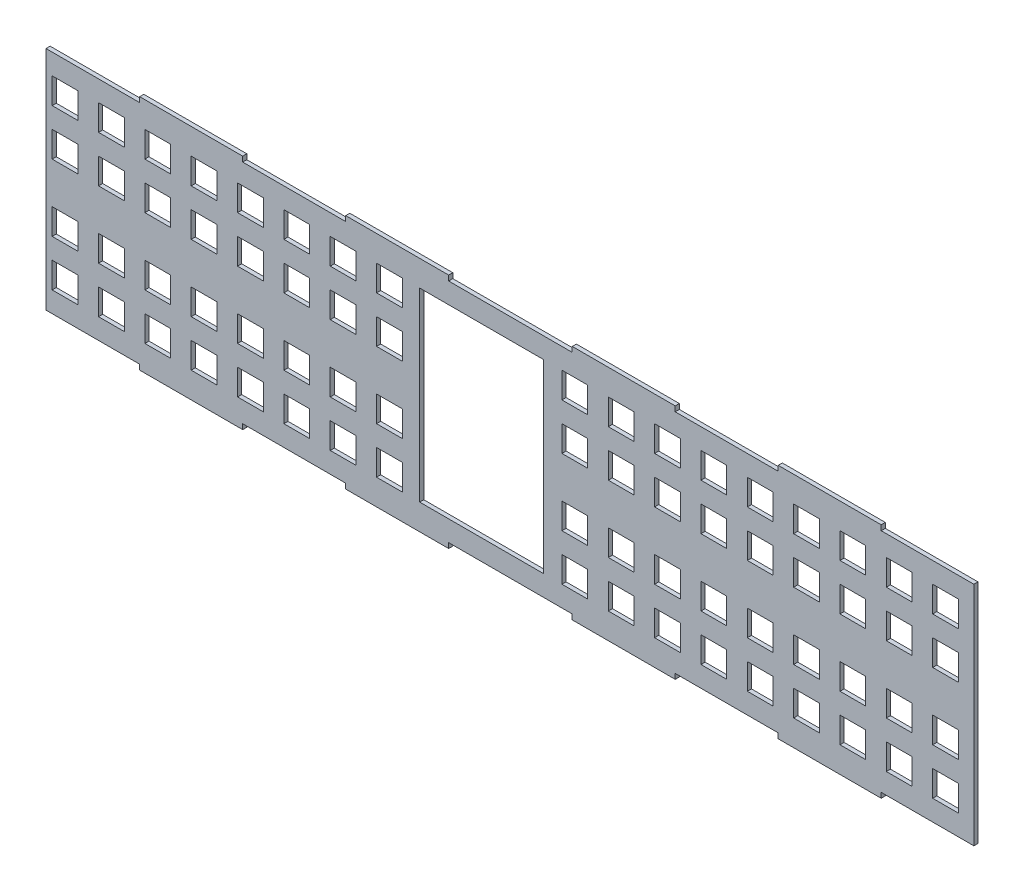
from build123d import *

# Parameters (mm, degrees)
SALIENTE_EXTRUIR1_DEPTH = 2
CROQUIS2_W              = 12.5
CROQUIS2_H              = 12.5
CORTAR_EXTRUIR1_DEPTH   = 5
CROQUIS5_W              = 12
CROQUIS5_H              = 110
CORTAR_EXTRUIR3_DEPTH   = 3
CROQUIS6_W              = 15
CROQUIS6_H              = 110
CORTAR_EXTRUIR4_DEPTH   = 3
CROQUIS7_W              = 2.5
CROQUIS7_H              = 110
CORTAR_EXTRUIR5_DEPTH   = 3
SKETCH1_W               = 60
SKETCH1_H               = 90
CUT_EXTRUDE1_DEPTH      = 3


with BuildPart() as part:
    # Croquis1 → Saliente-Extruir1 (new body)
    with BuildSketch(Plane.XY):
        Polygon((-240, -55), (-180, -55), (-180, -57.5), (-130, -57.5), (-130, -55), (-80, -55), (-80, -57.5), (-30, -57.5), (-30, -55), (30, -55), (30, -57.5), (80, -57.5), (80, -55), (130, -55), (130, -57.5), (180, -57.5), (180, -55), (240, -55), (240, 55), (180, 55), (180, 57.5), (130, 57.5), (130, 55), (80, 55), (80, 57.5), (30, 57.5), (30, 55), (-30, 55), (-30, 57.5), (-80, 57.5), (-80, 55), (-130, 55), (-130, 57.5), (-180, 57.5), (-180, 55), (-240, 55), align=None)
    extrude(amount=SALIENTE_EXTRUIR1_DEPTH)

    # Croquis2 → Cortar-Extruir1 (cut)
    with BuildSketch(Plane.XY.offset(2)):
        with Locations((-216.25, 16.25)):
            Rectangle(CROQUIS2_W, CROQUIS2_H)
        with Locations((-216.25, 38.75)):
            Rectangle(CROQUIS2_W, CROQUIS2_H)
        with Locations((-193.75, 38.75)):
            Rectangle(CROQUIS2_W, CROQUIS2_H)
        with Locations((-193.75, 16.25)):
            Rectangle(CROQUIS2_W, CROQUIS2_H)
        with Locations((-171.25, 16.25)):
            Rectangle(CROQUIS2_W, CROQUIS2_H)
        with Locations((-171.25, 38.75)):
            Rectangle(CROQUIS2_W, CROQUIS2_H)
        with Locations((-148.75, 38.75)):
            Rectangle(CROQUIS2_W, CROQUIS2_H)
        with Locations((-148.75, 16.25)):
            Rectangle(CROQUIS2_W, CROQUIS2_H)
        with Locations((-126.25, 16.25)):
            Rectangle(CROQUIS2_W, CROQUIS2_H)
        with Locations((-126.25, 38.75)):
            Rectangle(CROQUIS2_W, CROQUIS2_H)
        with Locations((-103.75, 38.75)):
            Rectangle(CROQUIS2_W, CROQUIS2_H)
        with Locations((-103.75, 16.25)):
            Rectangle(CROQUIS2_W, CROQUIS2_H)
        with Locations((-81.25, 16.25)):
            Rectangle(CROQUIS2_W, CROQUIS2_H)
        with Locations((-81.25, 38.75)):
            Rectangle(CROQUIS2_W, CROQUIS2_H)
        with Locations((-58.75, 38.75)):
            Rectangle(CROQUIS2_W, CROQUIS2_H)
        with Locations((-58.75, 16.25)):
            Rectangle(CROQUIS2_W, CROQUIS2_H)
        with Locations((-36.25, 16.25)):
            Rectangle(CROQUIS2_W, CROQUIS2_H)
        with Locations((-36.25, 38.75)):
            Rectangle(CROQUIS2_W, CROQUIS2_H)
        with Locations((-13.75, 38.75)):
            Rectangle(CROQUIS2_W, CROQUIS2_H)
        with Locations((-13.75, 16.25)):
            Rectangle(CROQUIS2_W, CROQUIS2_H)
        with Locations((8.75, 16.25)):
            Rectangle(CROQUIS2_W, CROQUIS2_H)
        with Locations((8.75, 38.75)):
            Rectangle(CROQUIS2_W, CROQUIS2_H)
        with Locations((31.25, 38.75)):
            Rectangle(CROQUIS2_W, CROQUIS2_H)
        with Locations((31.25, 16.25)):
            Rectangle(CROQUIS2_W, CROQUIS2_H)
        with Locations((53.75, 16.25)):
            Rectangle(CROQUIS2_W, CROQUIS2_H)
        with Locations((53.75, 38.75)):
            Rectangle(CROQUIS2_W, CROQUIS2_H)
        with Locations((76.25, 38.75)):
            Rectangle(CROQUIS2_W, CROQUIS2_H)
        with Locations((76.25, 16.25)):
            Rectangle(CROQUIS2_W, CROQUIS2_H)
        with Locations((98.75, 16.25)):
            Rectangle(CROQUIS2_W, CROQUIS2_H)
        with Locations((98.75, 38.75)):
            Rectangle(CROQUIS2_W, CROQUIS2_H)
        with Locations((121.25, 38.75)):
            Rectangle(CROQUIS2_W, CROQUIS2_H)
        with Locations((121.25, 16.25)):
            Rectangle(CROQUIS2_W, CROQUIS2_H)
        with Locations((143.75, 16.25)):
            Rectangle(CROQUIS2_W, CROQUIS2_H)
        with Locations((143.75, 38.75)):
            Rectangle(CROQUIS2_W, CROQUIS2_H)
        with Locations((166.25, 38.75)):
            Rectangle(CROQUIS2_W, CROQUIS2_H)
        with Locations((166.25, 16.25)):
            Rectangle(CROQUIS2_W, CROQUIS2_H)
        with Locations((188.75, 16.25)):
            Rectangle(CROQUIS2_W, CROQUIS2_H)
        with Locations((188.75, 38.75)):
            Rectangle(CROQUIS2_W, CROQUIS2_H)
        with Locations((211.25, 38.75)):
            Rectangle(CROQUIS2_W, CROQUIS2_H)
        with Locations((211.25, 16.25)):
            Rectangle(CROQUIS2_W, CROQUIS2_H)
        with Locations((211.25, -16.25)):
            Rectangle(CROQUIS2_W, CROQUIS2_H)
        with Locations((211.25, -38.75)):
            Rectangle(CROQUIS2_W, CROQUIS2_H)
        with Locations((188.75, -38.75)):
            Rectangle(CROQUIS2_W, CROQUIS2_H)
        with Locations((188.75, -16.25)):
            Rectangle(CROQUIS2_W, CROQUIS2_H)
        with Locations((166.25, -16.25)):
            Rectangle(CROQUIS2_W, CROQUIS2_H)
        with Locations((166.25, -38.75)):
            Rectangle(CROQUIS2_W, CROQUIS2_H)
        with Locations((143.75, -38.75)):
            Rectangle(CROQUIS2_W, CROQUIS2_H)
        with Locations((143.75, -16.25)):
            Rectangle(CROQUIS2_W, CROQUIS2_H)
        with Locations((121.25, -16.25)):
            Rectangle(CROQUIS2_W, CROQUIS2_H)
        with Locations((121.25, -38.75)):
            Rectangle(CROQUIS2_W, CROQUIS2_H)
        with Locations((98.75, -38.75)):
            Rectangle(CROQUIS2_W, CROQUIS2_H)
        with Locations((98.75, -16.25)):
            Rectangle(CROQUIS2_W, CROQUIS2_H)
        with Locations((76.25, -16.25)):
            Rectangle(CROQUIS2_W, CROQUIS2_H)
        with Locations((76.25, -38.75)):
            Rectangle(CROQUIS2_W, CROQUIS2_H)
        with Locations((53.75, -38.75)):
            Rectangle(CROQUIS2_W, CROQUIS2_H)
        with Locations((53.75, -16.25)):
            Rectangle(CROQUIS2_W, CROQUIS2_H)
        with Locations((31.25, -16.25)):
            Rectangle(CROQUIS2_W, CROQUIS2_H)
        with Locations((31.25, -38.75)):
            Rectangle(CROQUIS2_W, CROQUIS2_H)
        with Locations((8.75, -38.75)):
            Rectangle(CROQUIS2_W, CROQUIS2_H)
        with Locations((8.75, -16.25)):
            Rectangle(CROQUIS2_W, CROQUIS2_H)
        with Locations((-13.75, -16.25)):
            Rectangle(CROQUIS2_W, CROQUIS2_H)
        with Locations((-13.75, -38.75)):
            Rectangle(CROQUIS2_W, CROQUIS2_H)
        with Locations((-36.25, -38.75)):
            Rectangle(CROQUIS2_W, CROQUIS2_H)
        with Locations((-36.25, -16.25)):
            Rectangle(CROQUIS2_W, CROQUIS2_H)
        with Locations((-58.75, -16.25)):
            Rectangle(CROQUIS2_W, CROQUIS2_H)
        with Locations((-58.75, -38.75)):
            Rectangle(CROQUIS2_W, CROQUIS2_H)
        with Locations((-81.25, -38.75)):
            Rectangle(CROQUIS2_W, CROQUIS2_H)
        with Locations((-81.25, -16.25)):
            Rectangle(CROQUIS2_W, CROQUIS2_H)
        with Locations((-103.75, -16.25)):
            Rectangle(CROQUIS2_W, CROQUIS2_H)
        with Locations((-103.75, -38.75)):
            Rectangle(CROQUIS2_W, CROQUIS2_H)
        with Locations((-126.25, -38.75)):
            Rectangle(CROQUIS2_W, CROQUIS2_H)
        with Locations((-126.25, -16.25)):
            Rectangle(CROQUIS2_W, CROQUIS2_H)
        with Locations((-148.75, -16.25)):
            Rectangle(CROQUIS2_W, CROQUIS2_H)
        with Locations((-148.75, -38.75)):
            Rectangle(CROQUIS2_W, CROQUIS2_H)
        with Locations((-171.25, -38.75)):
            Rectangle(CROQUIS2_W, CROQUIS2_H)
        with Locations((-171.25, -16.25)):
            Rectangle(CROQUIS2_W, CROQUIS2_H)
        with Locations((-193.75, -16.25)):
            Rectangle(CROQUIS2_W, CROQUIS2_H)
        with Locations((-193.75, -38.75)):
            Rectangle(CROQUIS2_W, CROQUIS2_H)
        with Locations((-216.25, -38.75)):
            Rectangle(CROQUIS2_W, CROQUIS2_H)
        with Locations((-216.25, -16.25)):
            Rectangle(CROQUIS2_W, CROQUIS2_H)
    extrude(amount=-CORTAR_EXTRUIR1_DEPTH, mode=Mode.SUBTRACT)

    # Croquis5 → Cortar-Extruir3 (cut)
    with BuildSketch(Plane(origin=(0, 0, 0), x_dir=(-1, 0, 0), z_dir=(0, 0, -1))):
        with Locations((234, 0)):
            Rectangle(CROQUIS5_W, CROQUIS5_H)
    extrude(amount=-CORTAR_EXTRUIR3_DEPTH, mode=Mode.SUBTRACT)

    # Croquis6 → Cortar-Extruir4 (cut)
    with BuildSketch(Plane(origin=(0, 0, 0), x_dir=(-1, 0, 0), z_dir=(0, 0, -1))):
        with Locations((-232.5, 0)):
            Rectangle(CROQUIS6_W, CROQUIS6_H)
    extrude(amount=-CORTAR_EXTRUIR4_DEPTH, mode=Mode.SUBTRACT)

    # Croquis7 → Cortar-Extruir5 (cut)
    with BuildSketch(Plane.XY.offset(2)):
        with Locations((-226.75, 0)):
            Rectangle(CROQUIS7_W, CROQUIS7_H)
    extrude(amount=-CORTAR_EXTRUIR5_DEPTH, mode=Mode.SUBTRACT)

    # Sketch1 → Cut-Extrude1 (cut)
    with BuildSketch(Plane.XY.offset(2)):
        with Locations((-14.066271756, 0)):
            Rectangle(SKETCH1_W, SKETCH1_H)
    extrude(amount=-CUT_EXTRUDE1_DEPTH, mode=Mode.SUBTRACT)


solid = part.part
